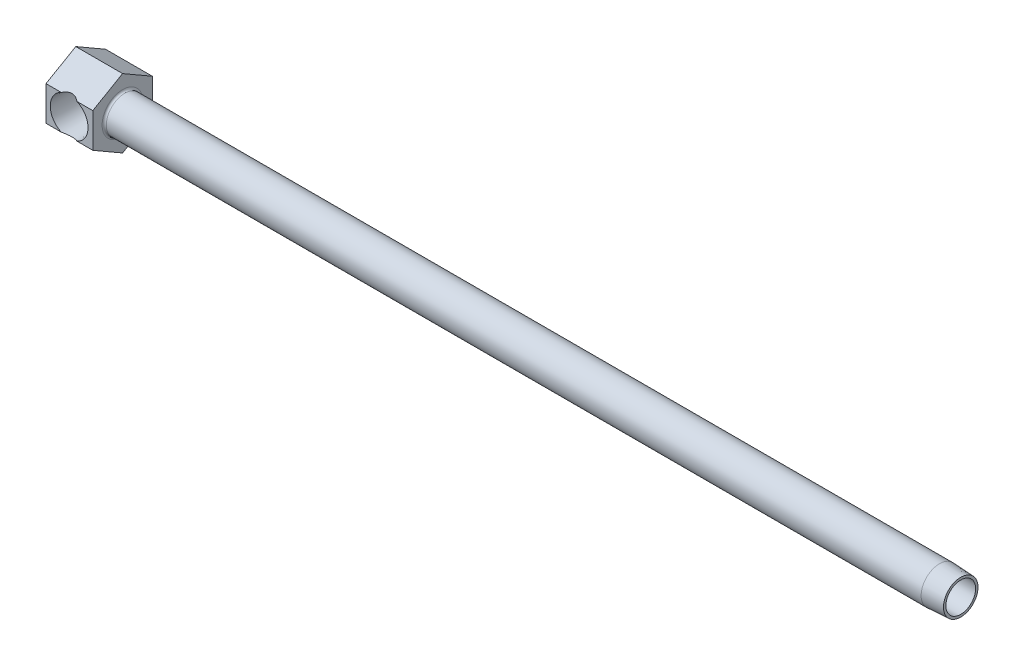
ISO-10303-21;
HEADER;
FILE_DESCRIPTION(('STEP AP214'),'2;1');
FILE_NAME('part.step','',(''),(''),'','','');
FILE_SCHEMA(('AUTOMOTIVE_DESIGN { 1 0 10303 214 1 1 1 1 }'));
ENDSEC;
DATA;
#1=APPLICATION_CONTEXT('core data for automotive mechanical design processes');
#2=APPLICATION_PROTOCOL_DEFINITION('international standard','automotive_design',2000,#1);
#3=PRODUCT_CONTEXT('',#1,'mechanical');
#4=PRODUCT('Part','Part','',(#3));
#5=PRODUCT_RELATED_PRODUCT_CATEGORY('part','',(#4));
#6=PRODUCT_DEFINITION_FORMATION('','',#4);
#7=PRODUCT_DEFINITION_CONTEXT('part definition',#1,'design');
#8=PRODUCT_DEFINITION('design','',#6,#7);
#9=PRODUCT_DEFINITION_SHAPE('','',#8);
#10=(LENGTH_UNIT() NAMED_UNIT(*) SI_UNIT(.MILLI.,.METRE.));
#11=(NAMED_UNIT(*) PLANE_ANGLE_UNIT() SI_UNIT($,.RADIAN.));
#12=(NAMED_UNIT(*) SI_UNIT($,.STERADIAN.) SOLID_ANGLE_UNIT());
#13=UNCERTAINTY_MEASURE_WITH_UNIT(LENGTH_MEASURE(1.E-05),#10,'distance_accuracy_value','');
#14=(GEOMETRIC_REPRESENTATION_CONTEXT(3) GLOBAL_UNCERTAINTY_ASSIGNED_CONTEXT((#13)) GLOBAL_UNIT_ASSIGNED_CONTEXT((#10,
#11,#12)) REPRESENTATION_CONTEXT('',''));
#15=CARTESIAN_POINT('',(0.,0.,0.));
#16=DIRECTION('',(0.,0.,1.));
#17=DIRECTION('',(1.,0.,0.));
#18=AXIS2_PLACEMENT_3D('',#15,#16,#17);
#19=CARTESIAN_POINT('',(63.5,0.,11.1125));
#20=DIRECTION('',(-1.,0.,0.));
#21=DIRECTION('',(0.,0.,1.));
#22=AXIS2_PLACEMENT_3D('',#19,#20,#21);
#23=CYLINDRICAL_SURFACE('',#22,6.858);
#24=CARTESIAN_POINT('',(18.2499,0.,11.1125));
#25=DIRECTION('',(-1.,0.,0.));
#26=DIRECTION('',(0.,-1.,0.));
#27=AXIS2_PLACEMENT_3D('',#24,#25,#26);
#28=CIRCLE('',#27,6.858);
#29=CARTESIAN_POINT('',(18.2499,-6.858,11.1125));
#30=VERTEX_POINT('',#29);
#31=EDGE_CURVE('E174',#30,#30,#28,.F.);
#32=ORIENTED_EDGE('',*,*,#31,.T.);
#33=EDGE_LOOP('',(#32));
#34=FACE_BOUND('',#33,.T.);
#35=CARTESIAN_POINT('',(322.2752,0.,11.1125));
#36=DIRECTION('',(1.,0.,0.));
#37=DIRECTION('',(0.,0.,-1.));
#38=AXIS2_PLACEMENT_3D('',#35,#36,#37);
#39=CIRCLE('',#38,6.858);
#40=CARTESIAN_POINT('',(322.2752,0.,4.2545));
#41=VERTEX_POINT('',#40);
#42=EDGE_CURVE('E218',#41,#41,#39,.T.);
#43=ORIENTED_EDGE('',*,*,#42,.F.);
#44=EDGE_LOOP('',(#43));
#45=FACE_BOUND('',#44,.T.);
#46=ADVANCED_FACE('F15',(#34,#45),#23,.T.);
#47=CARTESIAN_POINT('',(17.4625,6.4158048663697,22.225));
#48=DIRECTION('',(0.,0.,-1.));
#49=DIRECTION('',(0.,1.,0.));
#50=AXIS2_PLACEMENT_3D('',#47,#48,#49);
#51=PLANE('',#50);
#52=CARTESIAN_POINT('',(8.636,0.,22.225));
#53=DIRECTION('',(0.,0.,1.));
#54=DIRECTION('',(1.,0.,0.));
#55=AXIS2_PLACEMENT_3D('',#52,#53,#54);
#56=CIRCLE('',#55,7.05231);
#57=CARTESIAN_POINT('',(5.70811266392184,6.4158048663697,22.225));
#58=VERTEX_POINT('',#57);
#59=CARTESIAN_POINT('',(5.70811266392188,-6.41580486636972,22.225));
#60=VERTEX_POINT('',#59);
#61=EDGE_CURVE('E229',#58,#60,#56,.T.);
#62=ORIENTED_EDGE('',*,*,#61,.F.);
#63=DIRECTION('',(-1.,0.,0.));
#64=VECTOR('',#63,1.);
#65=CARTESIAN_POINT('',(17.4625,6.4158048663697,22.225));
#66=LINE('',#65,#64);
#67=CARTESIAN_POINT('',(0.,6.4158048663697,22.225));
#68=VERTEX_POINT('',#67);
#69=EDGE_CURVE('E158',#58,#68,#66,.T.);
#70=ORIENTED_EDGE('',*,*,#69,.T.);
#71=DIRECTION('',(0.,-1.,0.));
#72=VECTOR('',#71,1.);
#73=CARTESIAN_POINT('',(0.,6.4158048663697,22.225));
#74=LINE('',#73,#72);
#75=CARTESIAN_POINT('',(0.,-6.41580486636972,22.225));
#76=VERTEX_POINT('',#75);
#77=EDGE_CURVE('E128',#68,#76,#74,.T.);
#78=ORIENTED_EDGE('',*,*,#77,.T.);
#79=DIRECTION('',(-1.,0.,0.));
#80=VECTOR('',#79,1.);
#81=CARTESIAN_POINT('',(17.4625,-6.41580486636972,22.225));
#82=LINE('',#81,#80);
#83=EDGE_CURVE('E154',#60,#76,#82,.T.);
#84=ORIENTED_EDGE('',*,*,#83,.F.);
#85=EDGE_LOOP('',(#62,#70,#78,#84));
#86=FACE_BOUND('',#85,.T.);
#87=ADVANCED_FACE('F205',(#86),#51,.F.);
#88=CARTESIAN_POINT('',(11.5638873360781,-6.41580486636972,22.225));
#89=VERTEX_POINT('',#88);
#90=CARTESIAN_POINT('',(11.5638873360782,6.4158048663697,22.225));
#91=VERTEX_POINT('',#90);
#92=EDGE_CURVE('E228',#89,#91,#56,.T.);
#93=ORIENTED_EDGE('',*,*,#92,.F.);
#94=CARTESIAN_POINT('',(17.4625,-6.41580486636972,22.225));
#95=VERTEX_POINT('',#94);
#96=EDGE_CURVE('E155',#95,#89,#82,.T.);
#97=ORIENTED_EDGE('',*,*,#96,.F.);
#98=DIRECTION('',(0.,-1.,0.));
#99=VECTOR('',#98,1.);
#100=CARTESIAN_POINT('',(17.4625,6.4158048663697,22.225));
#101=LINE('',#100,#99);
#102=CARTESIAN_POINT('',(17.4625,6.4158048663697,22.225));
#103=VERTEX_POINT('',#102);
#104=EDGE_CURVE('E145',#103,#95,#101,.T.);
#105=ORIENTED_EDGE('',*,*,#104,.F.);
#106=EDGE_CURVE('E159',#103,#91,#66,.T.);
#107=ORIENTED_EDGE('',*,*,#106,.T.);
#108=EDGE_LOOP('',(#93,#97,#105,#107));
#109=FACE_BOUND('',#108,.T.);
#110=ADVANCED_FACE('F211',(#109),#51,.F.);
#111=CARTESIAN_POINT('',(17.4625,12.8316097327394,11.1125));
#112=DIRECTION('',(0.,-0.866025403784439,-0.5));
#113=DIRECTION('',(0.,0.5,-0.866025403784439));
#114=AXIS2_PLACEMENT_3D('',#111,#112,#113);
#115=PLANE('',#114);
#116=ORIENTED_EDGE('',*,*,#69,.F.);
#117=CARTESIAN_POINT('',(8.636,-0.384020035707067,34.002642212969));
#118=DIRECTION('',(0.,-0.866025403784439,-0.5));
#119=DIRECTION('',(0.,-0.5,0.866025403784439));
#120=AXIS2_PLACEMENT_3D('',#117,#118,#119);
#121=ELLIPSE('',#120,14.8098967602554,7.39498405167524);
#122=EDGE_CURVE('E109',#58,#91,#121,.T.);
#123=ORIENTED_EDGE('',*,*,#122,.T.);
#124=ORIENTED_EDGE('',*,*,#106,.F.);
#125=DIRECTION('',(0.,-0.5,0.866025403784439));
#126=VECTOR('',#125,1.);
#127=CARTESIAN_POINT('',(17.4625,12.8316097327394,11.1125));
#128=LINE('',#127,#126);
#129=CARTESIAN_POINT('',(17.4625,12.8316097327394,11.1125));
#130=VERTEX_POINT('',#129);
#131=EDGE_CURVE('E143',#130,#103,#128,.T.);
#132=ORIENTED_EDGE('',*,*,#131,.F.);
#133=DIRECTION('',(-1.,0.,0.));
#134=VECTOR('',#133,1.);
#135=CARTESIAN_POINT('',(17.4625,12.8316097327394,11.1125));
#136=LINE('',#135,#134);
#137=CARTESIAN_POINT('',(0.,12.8316097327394,11.1125));
#138=VERTEX_POINT('',#137);
#139=EDGE_CURVE('E162',#130,#138,#136,.T.);
#140=ORIENTED_EDGE('',*,*,#139,.T.);
#141=DIRECTION('',(0.,-0.5,0.866025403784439));
#142=VECTOR('',#141,1.);
#143=CARTESIAN_POINT('',(0.,12.8316097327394,11.1125));
#144=LINE('',#143,#142);
#145=EDGE_CURVE('E124',#138,#68,#144,.T.);
#146=ORIENTED_EDGE('',*,*,#145,.T.);
#147=EDGE_LOOP('',(#116,#123,#124,#132,#140,#146));
#148=FACE_BOUND('',#147,.T.);
#149=ADVANCED_FACE('F257',(#148),#115,.F.);
#150=CARTESIAN_POINT('',(17.4625,-6.41580486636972,22.225));
#151=DIRECTION('',(0.,0.866025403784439,-0.5));
#152=DIRECTION('',(0.,0.5,0.866025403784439));
#153=AXIS2_PLACEMENT_3D('',#150,#151,#152);
#154=PLANE('',#153);
#155=ORIENTED_EDGE('',*,*,#96,.T.);
#156=CARTESIAN_POINT('',(8.636,0.384020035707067,34.0026422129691));
#157=DIRECTION('',(0.,0.866025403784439,-0.5));
#158=DIRECTION('',(0.,0.5,0.866025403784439));
#159=AXIS2_PLACEMENT_3D('',#156,#157,#158);
#160=ELLIPSE('',#159,14.8098967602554,7.39498405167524);
#161=EDGE_CURVE('E34',#89,#60,#160,.T.);
#162=ORIENTED_EDGE('',*,*,#161,.T.);
#163=ORIENTED_EDGE('',*,*,#83,.T.);
#164=DIRECTION('',(0.,-0.5,-0.866025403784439));
#165=VECTOR('',#164,1.);
#166=CARTESIAN_POINT('',(0.,-6.41580486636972,22.225));
#167=LINE('',#166,#165);
#168=CARTESIAN_POINT('',(0.,-12.8316097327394,11.1125));
#169=VERTEX_POINT('',#168);
#170=EDGE_CURVE('E132',#76,#169,#167,.T.);
#171=ORIENTED_EDGE('',*,*,#170,.T.);
#172=DIRECTION('',(-1.,0.,0.));
#173=VECTOR('',#172,1.);
#174=CARTESIAN_POINT('',(17.4625,-12.8316097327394,11.1125));
#175=LINE('',#174,#173);
#176=CARTESIAN_POINT('',(17.4625,-12.8316097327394,11.1125));
#177=VERTEX_POINT('',#176);
#178=EDGE_CURVE('E149',#177,#169,#175,.T.);
#179=ORIENTED_EDGE('',*,*,#178,.F.);
#180=DIRECTION('',(0.,-0.5,-0.866025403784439));
#181=VECTOR('',#180,1.);
#182=CARTESIAN_POINT('',(17.4625,-6.41580486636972,22.225));
#183=LINE('',#182,#181);
#184=EDGE_CURVE('E147',#95,#177,#183,.T.);
#185=ORIENTED_EDGE('',*,*,#184,.F.);
#186=EDGE_LOOP('',(#155,#162,#163,#171,#179,#185));
#187=FACE_BOUND('',#186,.T.);
#188=ADVANCED_FACE('F235',(#187),#154,.F.);
#189=CARTESIAN_POINT('',(17.4625,-12.8316097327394,11.1125));
#190=DIRECTION('',(0.,0.866025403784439,0.5));
#191=DIRECTION('',(0.,-0.5,0.866025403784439));
#192=AXIS2_PLACEMENT_3D('',#189,#190,#191);
#193=PLANE('',#192);
#194=DIRECTION('',(0.,0.5,-0.866025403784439));
#195=VECTOR('',#194,1.);
#196=CARTESIAN_POINT('',(0.,-12.8316097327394,11.1125));
#197=LINE('',#196,#195);
#198=CARTESIAN_POINT('',(0.,-6.41580486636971,0.));
#199=VERTEX_POINT('',#198);
#200=EDGE_CURVE('E117',#169,#199,#197,.T.);
#201=ORIENTED_EDGE('',*,*,#200,.T.);
#202=DIRECTION('',(-1.,0.,0.));
#203=VECTOR('',#202,1.);
#204=CARTESIAN_POINT('',(17.4625,-6.41580486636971,0.));
#205=LINE('',#204,#203);
#206=CARTESIAN_POINT('',(17.4625,-6.41580486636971,0.));
#207=VERTEX_POINT('',#206);
#208=EDGE_CURVE('E168',#207,#199,#205,.T.);
#209=ORIENTED_EDGE('',*,*,#208,.F.);
#210=DIRECTION('',(0.,0.5,-0.866025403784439));
#211=VECTOR('',#210,1.);
#212=CARTESIAN_POINT('',(17.4625,-12.8316097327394,11.1125));
#213=LINE('',#212,#211);
#214=EDGE_CURVE('E135',#177,#207,#213,.T.);
#215=ORIENTED_EDGE('',*,*,#214,.F.);
#216=ORIENTED_EDGE('',*,*,#178,.T.);
#217=EDGE_LOOP('',(#201,#209,#215,#216));
#218=FACE_BOUND('',#217,.T.);
#219=ADVANCED_FACE('F247',(#218),#193,.F.);
#220=CARTESIAN_POINT('',(17.4625,-6.41580486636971,0.));
#221=DIRECTION('',(0.,0.,1.));
#222=DIRECTION('',(1.,0.,0.));
#223=AXIS2_PLACEMENT_3D('',#220,#221,#222);
#224=PLANE('',#223);
#225=DIRECTION('',(0.,1.,0.));
#226=VECTOR('',#225,1.);
#227=CARTESIAN_POINT('',(0.,-6.41580486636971,0.));
#228=LINE('',#227,#226);
#229=CARTESIAN_POINT('',(0.,6.41580486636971,0.));
#230=VERTEX_POINT('',#229);
#231=EDGE_CURVE('E118',#199,#230,#228,.T.);
#232=ORIENTED_EDGE('',*,*,#231,.T.);
#233=DIRECTION('',(-1.,0.,0.));
#234=VECTOR('',#233,1.);
#235=CARTESIAN_POINT('',(17.4625,6.41580486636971,0.));
#236=LINE('',#235,#234);
#237=CARTESIAN_POINT('',(17.4625,6.41580486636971,0.));
#238=VERTEX_POINT('',#237);
#239=EDGE_CURVE('E165',#238,#230,#236,.T.);
#240=ORIENTED_EDGE('',*,*,#239,.F.);
#241=DIRECTION('',(0.,1.,0.));
#242=VECTOR('',#241,1.);
#243=CARTESIAN_POINT('',(17.4625,-6.41580486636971,0.));
#244=LINE('',#243,#242);
#245=EDGE_CURVE('E139',#207,#238,#244,.T.);
#246=ORIENTED_EDGE('',*,*,#245,.F.);
#247=ORIENTED_EDGE('',*,*,#208,.T.);
#248=EDGE_LOOP('',(#232,#240,#246,#247));
#249=FACE_BOUND('',#248,.T.);
#250=ADVANCED_FACE('F264',(#249),#224,.F.);
#251=CARTESIAN_POINT('',(17.4625,6.4158048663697,0.));
#252=DIRECTION('',(0.,-0.866025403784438,0.5));
#253=DIRECTION('',(0.,-0.5,-0.866025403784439));
#254=AXIS2_PLACEMENT_3D('',#251,#252,#253);
#255=PLANE('',#254);
#256=DIRECTION('',(0.,0.5,0.866025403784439));
#257=VECTOR('',#256,1.);
#258=CARTESIAN_POINT('',(0.,6.4158048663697,0.));
#259=LINE('',#258,#257);
#260=EDGE_CURVE('E121',#230,#138,#259,.T.);
#261=ORIENTED_EDGE('',*,*,#260,.T.);
#262=ORIENTED_EDGE('',*,*,#139,.F.);
#263=DIRECTION('',(0.,0.5,0.866025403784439));
#264=VECTOR('',#263,1.);
#265=CARTESIAN_POINT('',(17.4625,6.4158048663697,0.));
#266=LINE('',#265,#264);
#267=EDGE_CURVE('E141',#238,#130,#266,.T.);
#268=ORIENTED_EDGE('',*,*,#267,.F.);
#269=ORIENTED_EDGE('',*,*,#239,.T.);
#270=EDGE_LOOP('',(#261,#262,#268,#269));
#271=FACE_BOUND('',#270,.T.);
#272=ADVANCED_FACE('F261',(#271),#255,.F.);
#273=CARTESIAN_POINT('',(17.4625,-19.2474145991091,22.225));
#274=DIRECTION('',(-1.,0.,0.));
#275=DIRECTION('',(0.,-1.,0.));
#276=AXIS2_PLACEMENT_3D('',#273,#274,#275);
#277=PLANE('',#276);
#278=CARTESIAN_POINT('',(17.4625,0.,11.1125));
#279=DIRECTION('',(-1.,0.,0.));
#280=DIRECTION('',(0.,-1.,0.));
#281=AXIS2_PLACEMENT_3D('',#278,#279,#280);
#282=CIRCLE('',#281,7.6454);
#283=CARTESIAN_POINT('',(17.4625,-7.6454,11.1125));
#284=VERTEX_POINT('',#283);
#285=EDGE_CURVE('E171',#284,#284,#282,.T.);
#286=ORIENTED_EDGE('',*,*,#285,.T.);
#287=EDGE_LOOP('',(#286));
#288=FACE_BOUND('',#287,.T.);
#289=ORIENTED_EDGE('',*,*,#214,.T.);
#290=ORIENTED_EDGE('',*,*,#245,.T.);
#291=ORIENTED_EDGE('',*,*,#267,.T.);
#292=ORIENTED_EDGE('',*,*,#131,.T.);
#293=ORIENTED_EDGE('',*,*,#104,.T.);
#294=ORIENTED_EDGE('',*,*,#184,.T.);
#295=EDGE_LOOP('',(#289,#290,#291,#292,#293,#294));
#296=FACE_BOUND('',#295,.T.);
#297=ADVANCED_FACE('F250',(#288,#296),#277,.F.);
#298=CARTESIAN_POINT('',(0.,-19.2474145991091,22.225));
#299=DIRECTION('',(-1.,0.,0.));
#300=DIRECTION('',(0.,-1.,0.));
#301=AXIS2_PLACEMENT_3D('',#298,#299,#300);
#302=PLANE('',#301);
#303=ORIENTED_EDGE('',*,*,#200,.F.);
#304=ORIENTED_EDGE('',*,*,#170,.F.);
#305=ORIENTED_EDGE('',*,*,#77,.F.);
#306=ORIENTED_EDGE('',*,*,#145,.F.);
#307=ORIENTED_EDGE('',*,*,#260,.F.);
#308=ORIENTED_EDGE('',*,*,#231,.F.);
#309=EDGE_LOOP('',(#303,#304,#305,#306,#307,#308));
#310=FACE_BOUND('',#309,.T.);
#311=ADVANCED_FACE('F243',(#310),#302,.T.);
#312=CARTESIAN_POINT('',(18.2499,0.,11.1125));
#313=DIRECTION('',(-1.,0.,0.));
#314=DIRECTION('',(0.,-1.,0.));
#315=AXIS2_PLACEMENT_3D('',#312,#313,#314);
#316=TOROIDAL_SURFACE('',#315,7.6454,0.7874);
#317=ORIENTED_EDGE('',*,*,#31,.F.);
#318=EDGE_LOOP('',(#317));
#319=FACE_BOUND('',#318,.T.);
#320=ORIENTED_EDGE('',*,*,#285,.F.);
#321=EDGE_LOOP('',(#320));
#322=FACE_BOUND('',#321,.T.);
#323=ADVANCED_FACE('F282',(#319,#322),#316,.F.);
#324=CARTESIAN_POINT('',(63.5,0.,11.1125));
#325=DIRECTION('',(1.,0.,0.));
#326=DIRECTION('',(0.,0.,-1.));
#327=AXIS2_PLACEMENT_3D('',#324,#325,#326);
#328=CYLINDRICAL_SURFACE('',#327,5.5499);
#329=DIRECTION('',(1.,0.,0.));
#330=VECTOR('',#329,1.);
#331=CARTESIAN_POINT('',(63.5,1.29165930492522,5.715));
#332=LINE('',#331,#330);
#333=CARTESIAN_POINT('',(15.0655177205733,1.29165930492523,5.715));
#334=VERTEX_POINT('',#333);
#335=CARTESIAN_POINT('',(14.0465577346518,1.29165930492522,5.715));
#336=VERTEX_POINT('',#335);
#337=EDGE_CURVE('E27',#334,#336,#332,.F.);
#338=ORIENTED_EDGE('',*,*,#337,.T.);
#339=CARTESIAN_POINT('',(14.0465577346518,1.29165930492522,5.715));
#340=CARTESIAN_POINT('',(14.0725617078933,1.1828202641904,5.68893317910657));
#341=CARTESIAN_POINT('',(14.0954190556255,1.0724477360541,5.66602138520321));
#342=CARTESIAN_POINT('',(14.1345363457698,0.849345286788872,5.62681178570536));
#343=CARTESIAN_POINT('',(14.1507939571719,0.736614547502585,5.61051631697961));
#344=CARTESIAN_POINT('',(14.1760383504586,0.512691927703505,5.58521342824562));
#345=CARTESIAN_POINT('',(14.1852120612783,0.401542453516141,5.57601863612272));
#346=CARTESIAN_POINT('',(14.1968530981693,0.17856718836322,5.56435088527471));
#347=CARTESIAN_POINT('',(14.1993222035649,0.0667415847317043,5.56187614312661));
#348=CARTESIAN_POINT('',(14.1975723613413,-0.14949882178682,5.56362999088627));
#349=CARTESIAN_POINT('',(14.193779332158,-0.253921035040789,5.56743168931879));
#350=CARTESIAN_POINT('',(14.1803598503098,-0.462026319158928,5.58088200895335));
#351=CARTESIAN_POINT('',(14.1707325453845,-0.565709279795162,5.59053148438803));
#352=CARTESIAN_POINT('',(14.1454600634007,-0.774399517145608,5.61586264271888));
#353=CARTESIAN_POINT('',(14.12966315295,-0.87936981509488,5.63169642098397));
#354=CARTESIAN_POINT('',(14.092340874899,-1.08722287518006,5.6691068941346));
#355=CARTESIAN_POINT('',(14.0708169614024,-1.1901061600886,5.69068213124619));
#356=CARTESIAN_POINT('',(14.0465577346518,-1.29165930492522,5.715));
#357=B_SPLINE_CURVE_WITH_KNOTS('',3,(#339,#340,#341,#342,#343,#344,#345,#346,#347,#348,#349,
#350,#351,#352,#353,#354,#355,#356),.UNSPECIFIED.,.F.,.F.,(4,2,2,2,2,2,2,2,4),(0.,
0.344637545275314,0.689396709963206,1.02471413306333,1.35994255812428,1.67329546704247,
1.98669416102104,2.30834220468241,2.62990865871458),.UNSPECIFIED.);
#358=CARTESIAN_POINT('',(14.0465577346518,-1.29165930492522,5.715));
#359=VERTEX_POINT('',#358);
#360=EDGE_CURVE('E10',#336,#359,#357,.T.);
#361=ORIENTED_EDGE('',*,*,#360,.T.);
#362=DIRECTION('',(1.,0.,0.));
#363=VECTOR('',#362,1.);
#364=CARTESIAN_POINT('',(63.5,-1.29165930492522,5.715));
#365=LINE('',#364,#363);
#366=CARTESIAN_POINT('',(15.0655177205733,-1.29165930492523,5.715));
#367=VERTEX_POINT('',#366);
#368=EDGE_CURVE('E184',#359,#367,#365,.T.);
#369=ORIENTED_EDGE('',*,*,#368,.T.);
#370=CARTESIAN_POINT('',(15.0656795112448,-1.29082327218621,5.71480000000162));
#371=CARTESIAN_POINT('',(15.0372536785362,-1.43791824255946,5.7499521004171));
#372=CARTESIAN_POINT('',(15.0041876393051,-1.58262926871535,5.79093746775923));
#373=CARTESIAN_POINT('',(14.9298152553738,-1.86616189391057,5.88364074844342));
#374=CARTESIAN_POINT('',(14.8885204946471,-2.00499144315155,5.93534357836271));
#375=CARTESIAN_POINT('',(14.7990709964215,-2.27477346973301,6.0481148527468));
#376=CARTESIAN_POINT('',(14.7509848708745,-2.40578805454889,6.10909004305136));
#377=CARTESIAN_POINT('',(14.6486806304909,-2.66083130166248,6.2399326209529));
#378=CARTESIAN_POINT('',(14.5944604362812,-2.78485757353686,6.30980302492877));
#379=CARTESIAN_POINT('',(14.4812536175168,-3.02482355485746,6.4572285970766));
#380=CARTESIAN_POINT('',(14.4222960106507,-3.1408054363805,6.53473755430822));
#381=CARTESIAN_POINT('',(14.3003856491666,-3.365215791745,6.6970845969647));
#382=CARTESIAN_POINT('',(14.2374332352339,-3.47364490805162,6.78192205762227));
#383=CARTESIAN_POINT('',(14.0435453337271,-3.78827180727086,7.04729631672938));
#384=CARTESIAN_POINT('',(13.9079456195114,-3.9830565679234,7.23822682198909));
#385=CARTESIAN_POINT('',(13.689310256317,-4.26816238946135,7.56146618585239));
#386=CARTESIAN_POINT('',(13.6074310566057,-4.3686517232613,7.68585924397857));
#387=CARTESIAN_POINT('',(13.4442899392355,-4.55879004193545,7.94320688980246));
#388=CARTESIAN_POINT('',(13.3630282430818,-4.6484352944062,8.07616440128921));
#389=CARTESIAN_POINT('',(13.2036424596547,-4.81645966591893,8.35044586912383));
#390=CARTESIAN_POINT('',(13.1255135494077,-4.89485662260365,8.49175606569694));
#391=CARTESIAN_POINT('',(12.9752684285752,-5.04004510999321,8.78316437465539));
#392=CARTESIAN_POINT('',(12.9031480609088,-5.10684469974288,8.93325628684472));
#393=CARTESIAN_POINT('',(12.757824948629,-5.23785122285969,9.26762207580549));
#394=CARTESIAN_POINT('',(12.686320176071,-5.29990617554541,9.45350692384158));
#395=CARTESIAN_POINT('',(12.5645322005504,-5.40502712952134,9.83721903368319));
#396=CARTESIAN_POINT('',(12.5142004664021,-5.44813656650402,10.035017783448));
#397=CARTESIAN_POINT('',(12.4606756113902,-5.49679755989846,10.3395644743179));
#398=CARTESIAN_POINT('',(12.4464754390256,-5.51038902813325,10.443158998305));
#399=CARTESIAN_POINT('',(12.4264834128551,-5.5317354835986,10.6517762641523));
#400=CARTESIAN_POINT('',(12.4206908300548,-5.53949097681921,10.7567988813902));
#401=CARTESIAN_POINT('',(12.4179376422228,-5.54899639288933,10.9671942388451));
#402=CARTESIAN_POINT('',(12.4209736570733,-5.55074861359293,11.0725668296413));
#403=CARTESIAN_POINT('',(12.4357182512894,-5.54828805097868,11.2826067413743));
#404=CARTESIAN_POINT('',(12.4474268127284,-5.54407527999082,11.3872740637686));
#405=CARTESIAN_POINT('',(12.4900727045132,-5.52483789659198,11.6684350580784));
#406=CARTESIAN_POINT('',(12.5287513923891,-5.5042766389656,11.8434168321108));
#407=CARTESIAN_POINT('',(12.6245766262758,-5.44793106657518,12.1856637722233));
#408=CARTESIAN_POINT('',(12.6817493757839,-5.41212512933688,12.3529176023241));
#409=CARTESIAN_POINT('',(12.8020710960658,-5.33165221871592,12.6608364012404));
#410=CARTESIAN_POINT('',(12.8638814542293,-5.28838367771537,12.8024081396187));
#411=CARTESIAN_POINT('',(12.9946271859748,-5.19196308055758,13.0788046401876));
#412=CARTESIAN_POINT('',(13.0635675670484,-5.13880405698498,13.2136245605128));
#413=CARTESIAN_POINT('',(13.2061680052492,-5.0230773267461,13.476991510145));
#414=CARTESIAN_POINT('',(13.2798387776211,-4.96048779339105,13.6055230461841));
#415=CARTESIAN_POINT('',(13.4297455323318,-4.82635797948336,13.8561944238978));
#416=CARTESIAN_POINT('',(13.505980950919,-4.75481965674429,13.9783356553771));
#417=CARTESIAN_POINT('',(13.664111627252,-4.59832635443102,14.2236446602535));
#418=CARTESIAN_POINT('',(13.7460684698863,-4.51281916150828,14.3464205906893));
#419=CARTESIAN_POINT('',(13.9094765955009,-4.33199713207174,14.5849036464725));
#420=CARTESIAN_POINT('',(13.9909278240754,-4.23668125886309,14.7006100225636));
#421=CARTESIAN_POINT('',(14.1517819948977,-4.03638256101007,14.9245234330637));
#422=CARTESIAN_POINT('',(14.231187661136,-3.93141354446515,15.0327408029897));
#423=CARTESIAN_POINT('',(14.3867175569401,-3.71172769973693,15.2413555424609));
#424=CARTESIAN_POINT('',(14.4628409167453,-3.59700831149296,15.3417508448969));
#425=CARTESIAN_POINT('',(14.668135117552,-3.26437402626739,15.6091426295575));
#426=CARTESIAN_POINT('',(14.7924014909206,-3.03572507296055,15.7670513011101));
#427=CARTESIAN_POINT('',(14.961823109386,-2.67104021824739,15.9794040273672));
#428=CARTESIAN_POINT('',(15.0154673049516,-2.54586009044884,16.0461031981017));
#429=CARTESIAN_POINT('',(15.1161712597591,-2.28856209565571,16.1705894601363));
#430=CARTESIAN_POINT('',(15.1632322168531,-2.15644549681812,16.2283781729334));
#431=CARTESIAN_POINT('',(15.2428146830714,-1.9076542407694,16.3256678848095));
#432=CARTESIAN_POINT('',(15.2764575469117,-1.79190088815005,16.3666154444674));
#433=CARTESIAN_POINT('',(15.3378292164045,-1.55651069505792,16.4410921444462));
#434=CARTESIAN_POINT('',(15.3655591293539,-1.43687458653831,16.4746226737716));
#435=CARTESIAN_POINT('',(15.4145953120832,-1.19439983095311,16.5337884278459));
#436=CARTESIAN_POINT('',(15.4359031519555,-1.0715619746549,16.5594255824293));
#437=CARTESIAN_POINT('',(15.4716760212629,-0.823504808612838,16.6024058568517));
#438=CARTESIAN_POINT('',(15.4861437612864,-0.698286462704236,16.6197522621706));
#439=CARTESIAN_POINT('',(15.5079865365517,-0.445852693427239,16.645922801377));
#440=CARTESIAN_POINT('',(15.5153340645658,-0.318631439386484,16.6547138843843));
#441=CARTESIAN_POINT('',(15.522677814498,-0.063671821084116,16.6635004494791));
#442=CARTESIAN_POINT('',(15.5226740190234,0.0640665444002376,16.6634959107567));
#443=CARTESIAN_POINT('',(15.5153149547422,0.319031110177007,16.6546910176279));
#444=CARTESIAN_POINT('',(15.5079593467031,0.446257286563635,16.64589025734));
#445=CARTESIAN_POINT('',(15.4860583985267,0.699182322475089,16.6196499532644));
#446=CARTESIAN_POINT('',(15.4715132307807,0.824881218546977,16.6022106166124));
#447=CARTESIAN_POINT('',(15.4365532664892,1.06681669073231,16.5602063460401));
#448=CARTESIAN_POINT('',(15.4165150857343,1.18318753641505,16.5360979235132));
#449=CARTESIAN_POINT('',(15.370668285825,1.41308832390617,16.4807930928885));
#450=CARTESIAN_POINT('',(15.3448577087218,1.52661728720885,16.4495942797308));
#451=CARTESIAN_POINT('',(15.2593968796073,1.8619852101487,16.3459550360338));
#452=CARTESIAN_POINT('',(15.1916934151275,2.07876635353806,16.2634431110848));
#453=CARTESIAN_POINT('',(15.0313088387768,2.51543897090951,16.0659794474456));
#454=CARTESIAN_POINT('',(14.9368359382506,2.73357267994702,15.9486491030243));
#455=CARTESIAN_POINT('',(14.7321201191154,3.14711164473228,15.6903358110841));
#456=CARTESIAN_POINT('',(14.6218705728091,3.34250728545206,15.549342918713));
#457=CARTESIAN_POINT('',(14.3660176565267,3.74896640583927,15.2149275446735));
#458=CARTESIAN_POINT('',(14.217881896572,3.95452519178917,15.0167316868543));
#459=CARTESIAN_POINT('',(13.9905991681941,4.23685264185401,14.7000501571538));
#460=CARTESIAN_POINT('',(13.9138995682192,4.32671599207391,14.5911203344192));
#461=CARTESIAN_POINT('',(13.7600052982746,4.49774000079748,14.366972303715));
#462=CARTESIAN_POINT('',(13.682810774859,4.57890311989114,14.2517558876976));
#463=CARTESIAN_POINT('',(13.5283146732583,4.73340315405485,14.0136509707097));
#464=CARTESIAN_POINT('',(13.4510233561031,4.80663208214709,13.8906858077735));
#465=CARTESIAN_POINT('',(13.2989020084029,4.94395744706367,13.6382338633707));
#466=CARTESIAN_POINT('',(13.2240725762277,5.00805167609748,13.5087455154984));
#467=CARTESIAN_POINT('',(13.0790371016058,5.12664196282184,13.2432341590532));
#468=CARTESIAN_POINT('',(13.0088235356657,5.18115389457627,13.107222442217));
#469=CARTESIAN_POINT('',(12.8755190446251,5.28008101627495,12.8283198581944));
#470=CARTESIAN_POINT('',(12.8124234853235,5.3245027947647,12.6854335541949));
#471=CARTESIAN_POINT('',(12.6833891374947,5.4112685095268,12.3591277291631));
#472=CARTESIAN_POINT('',(12.6200540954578,5.45085356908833,12.1738679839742));
#473=CARTESIAN_POINT('',(12.5423523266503,5.49611259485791,11.8892630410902));
#474=CARTESIAN_POINT('',(12.5193453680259,5.50884182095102,11.7933456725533));
#475=CARTESIAN_POINT('',(12.4799604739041,5.52933440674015,11.5996550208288));
#476=CARTESIAN_POINT('',(12.4635791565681,5.53710030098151,11.5018827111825));
#477=CARTESIAN_POINT('',(12.4380468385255,5.54748556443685,11.3040796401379));
#478=CARTESIAN_POINT('',(12.4289726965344,5.55005064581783,11.2040359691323));
#479=CARTESIAN_POINT('',(12.418786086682,5.54973569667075,11.0035516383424));
#480=CARTESIAN_POINT('',(12.4176731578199,5.54685598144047,10.9031110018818));
#481=CARTESIAN_POINT('',(12.4234254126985,5.53566138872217,10.7027211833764));
#482=CARTESIAN_POINT('',(12.4302942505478,5.52734402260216,10.6027722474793));
#483=CARTESIAN_POINT('',(12.4515981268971,5.5054275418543,10.4042328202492));
#484=CARTESIAN_POINT('',(12.4660373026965,5.4918255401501,10.3056431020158));
#485=CARTESIAN_POINT('',(12.5044721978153,5.45712893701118,10.0955734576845));
#486=CARTESIAN_POINT('',(12.5295946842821,5.43520467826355,9.98443807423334));
#487=CARTESIAN_POINT('',(12.5874763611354,5.38514310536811,9.76556012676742));
#488=CARTESIAN_POINT('',(12.6202414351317,5.35700100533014,9.65782024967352));
#489=CARTESIAN_POINT('',(12.6919869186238,5.29489520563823,9.44585515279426));
#490=CARTESIAN_POINT('',(12.7309829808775,5.2609168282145,9.34163960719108));
#491=CARTESIAN_POINT('',(12.813732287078,5.18758941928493,9.13712531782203));
#492=CARTESIAN_POINT('',(12.8574843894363,5.14824167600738,9.03682564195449));
#493=CARTESIAN_POINT('',(12.9739768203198,5.04107082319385,8.78510193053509));
#494=CARTESIAN_POINT('',(13.0492646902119,4.96961386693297,8.63639571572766));
#495=CARTESIAN_POINT('',(13.2048344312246,4.81508369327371,8.34787401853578));
#496=CARTESIAN_POINT('',(13.2851189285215,4.73200433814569,8.20806329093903));
#497=CARTESIAN_POINT('',(13.4480056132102,4.55446924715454,7.93688996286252));
#498=CARTESIAN_POINT('',(13.5306114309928,4.45999483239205,7.80554179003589));
#499=CARTESIAN_POINT('',(13.6957298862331,4.25996324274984,7.55156980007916));
#500=CARTESIAN_POINT('',(13.7782425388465,4.15440825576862,7.42894426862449));
#501=CARTESIAN_POINT('',(13.9441031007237,3.92836612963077,7.18853642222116));
#502=CARTESIAN_POINT('',(14.0273794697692,3.80748613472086,7.0710730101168));
#503=CARTESIAN_POINT('',(14.1898135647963,3.55392137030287,6.84638586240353));
#504=CARTESIAN_POINT('',(14.2689704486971,3.42123420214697,6.73916421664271));
#505=CARTESIAN_POINT('',(14.420885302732,3.14485348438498,6.53641941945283));
#506=CARTESIAN_POINT('',(14.4936705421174,3.0012123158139,6.44084565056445));
#507=CARTESIAN_POINT('',(14.6312840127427,2.70291662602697,6.2621549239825));
#508=CARTESIAN_POINT('',(14.6961173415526,2.54826926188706,6.17902997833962));
#509=CARTESIAN_POINT('',(14.8204425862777,2.21665612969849,6.02094073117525));
#510=CARTESIAN_POINT('',(14.8791782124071,2.03888590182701,5.94704372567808));
#511=CARTESIAN_POINT('',(14.957111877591,1.76426185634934,5.84958505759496));
#512=CARTESIAN_POINT('',(14.9814347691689,1.67119024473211,5.81928093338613));
#513=CARTESIAN_POINT('',(15.0263924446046,1.48269404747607,5.76341790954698));
#514=CARTESIAN_POINT('',(15.047024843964,1.38726798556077,5.73786207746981));
#515=CARTESIAN_POINT('',(15.0656795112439,1.2908232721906,5.71480000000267));
#516=B_SPLINE_CURVE_WITH_KNOTS('',3,(#370,#371,#372,#373,#374,#375,#376,#377,#378,#379,#380,
#381,#382,#383,#384,#385,#386,#387,#388,#389,#390,#391,#392,#393,#394,#395,#396,#397,#398,#399,
#400,#401,#402,#403,#404,#405,#406,#407,#408,#409,#410,#411,#412,#413,#414,#415,#416,#417,#418,
#419,#420,#421,#422,#423,#424,#425,#426,#427,#428,#429,#430,#431,#432,#433,#434,#435,#436,#437,
#438,#439,#440,#441,#442,#443,#444,#445,#446,#447,#448,#449,#450,#451,#452,#453,#454,#455,#456,
#457,#458,#459,#460,#461,#462,#463,#464,#465,#466,#467,#468,#469,#470,#471,#472,#473,#474,#475,
#476,#477,#478,#479,#480,#481,#482,#483,#484,#485,#486,#487,#488,#489,#490,#491,#492,#493,#494,
#495,#496,#497,#498,#499,#500,#501,#502,#503,#504,#505,#506,#507,#508,#509,#510,#511,#512,#513,
#514,#515),.UNSPECIFIED.,.F.,.F.,(4,2,2,2,2,2,2,2,2,2,2,2,2,2,2,2,2,2,2,2,2,2,2,2,2,2,2,2,2,2,2,
2,2,2,2,2,2,2,2,2,2,2,2,2,2,2,2,2,2,2,2,2,2,2,2,2,2,2,2,2,2,2,2,2,2,2,2,2,2,2,2,2,4),(0.,
0.461329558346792,0.922014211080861,1.37833951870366,1.83481998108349,2.2886910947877,
2.74252355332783,3.65304009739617,4.19159436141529,4.73033346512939,5.26820855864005,
5.80570837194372,6.42981366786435,7.05248053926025,7.36837231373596,7.68423669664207,
7.99998016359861,8.31572297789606,8.85459341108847,9.39423071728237,9.87481564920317,
10.3557404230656,10.837795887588,11.3197460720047,11.8310943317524,12.3424966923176,
12.8531785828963,13.3639949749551,14.2729996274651,14.7275015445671,15.1819206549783,
15.5634665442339,15.9449409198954,16.3263219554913,16.707551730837,17.0902484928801,
17.472946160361,17.8556614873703,18.2383676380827,18.5995247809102,18.9608046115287,
19.682873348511,20.4753483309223,21.2681572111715,22.2295647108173,22.7113905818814,
23.1930798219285,23.6806666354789,24.1683710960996,24.6552598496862,25.1418297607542,
25.7388115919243,26.0368814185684,26.3347989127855,26.6358104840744,26.9368046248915,
27.237936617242,27.5392333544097,27.8867825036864,28.2346001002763,28.5833055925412,
28.9319275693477,29.4751694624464,30.0186993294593,30.5631325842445,31.1074585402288,
31.6708023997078,32.2342609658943,32.7951763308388,33.3557302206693,33.9579898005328,
34.2603814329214,34.5629677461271),.UNSPECIFIED.);
#517=EDGE_CURVE('E177',#367,#334,#516,.T.);
#518=ORIENTED_EDGE('',*,*,#517,.T.);
#519=EDGE_LOOP('',(#338,#361,#369,#518));
#520=FACE_BOUND('',#519,.T.);
#521=CARTESIAN_POINT('',(330.2,0.,11.1125));
#522=DIRECTION('',(1.,0.,0.));
#523=DIRECTION('',(0.,0.,-1.));
#524=AXIS2_PLACEMENT_3D('',#521,#522,#523);
#525=CIRCLE('',#524,5.5499);
#526=CARTESIAN_POINT('',(330.2,0.,5.5626));
#527=VERTEX_POINT('',#526);
#528=EDGE_CURVE('E223',#527,#527,#525,.T.);
#529=ORIENTED_EDGE('',*,*,#528,.T.);
#530=EDGE_LOOP('',(#529));
#531=FACE_BOUND('',#530,.T.);
#532=ADVANCED_FACE('F185',(#520,#531),#328,.F.);
#533=CARTESIAN_POINT('',(14.1986,0.,5.715));
#534=DIRECTION('',(0.,0.,-1.));
#535=DIRECTION('',(-1.,0.,0.));
#536=AXIS2_PLACEMENT_3D('',#533,#534,#535);
#537=PLANE('',#536);
#538=CARTESIAN_POINT('',(8.636,0.,5.715));
#539=DIRECTION('',(0.,0.,1.));
#540=DIRECTION('',(1.,0.,0.));
#541=AXIS2_PLACEMENT_3D('',#538,#539,#540);
#542=CIRCLE('',#541,6.55797849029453);
#543=EDGE_CURVE('E41',#334,#367,#542,.T.);
#544=ORIENTED_EDGE('',*,*,#543,.T.);
#545=ORIENTED_EDGE('',*,*,#368,.F.);
#546=CARTESIAN_POINT('',(8.636,0.,5.715));
#547=DIRECTION('',(0.,0.,1.));
#548=DIRECTION('',(1.,0.,0.));
#549=AXIS2_PLACEMENT_3D('',#546,#547,#548);
#550=CIRCLE('',#549,5.5626);
#551=EDGE_CURVE('E107',#336,#359,#550,.T.);
#552=ORIENTED_EDGE('',*,*,#551,.F.);
#553=ORIENTED_EDGE('',*,*,#337,.F.);
#554=EDGE_LOOP('',(#544,#545,#552,#553));
#555=FACE_BOUND('',#554,.T.);
#556=ADVANCED_FACE('F194',(#555),#537,.F.);
#557=CARTESIAN_POINT('',(8.636,0.,22.225));
#558=DIRECTION('',(0.,0.,1.));
#559=DIRECTION('',(1.,0.,0.));
#560=AXIS2_PLACEMENT_3D('',#557,#558,#559);
#561=CYLINDRICAL_SURFACE('',#560,5.5626);
#562=CARTESIAN_POINT('',(8.636,0.,4.445));
#563=DIRECTION('',(0.,0.,1.));
#564=DIRECTION('',(1.,0.,0.));
#565=AXIS2_PLACEMENT_3D('',#562,#563,#564);
#566=CIRCLE('',#565,5.5626);
#567=CARTESIAN_POINT('',(14.1986,0.,4.445));
#568=VERTEX_POINT('',#567);
#569=EDGE_CURVE('E105',#568,#568,#566,.T.);
#570=ORIENTED_EDGE('',*,*,#569,.F.);
#571=EDGE_LOOP('',(#570));
#572=FACE_BOUND('',#571,.T.);
#573=ORIENTED_EDGE('',*,*,#551,.T.);
#574=ORIENTED_EDGE('',*,*,#360,.F.);
#575=EDGE_LOOP('',(#573,#574));
#576=FACE_BOUND('',#575,.T.);
#577=ADVANCED_FACE('F192',(#572,#576),#561,.F.);
#578=CARTESIAN_POINT('',(8.636,0.,22.225));
#579=DIRECTION('',(0.,0.,1.));
#580=DIRECTION('',(1.,0.,0.));
#581=AXIS2_PLACEMENT_3D('',#578,#579,#580);
#582=CONICAL_SURFACE('',#581,7.05231,0.0299323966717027);
#583=ORIENTED_EDGE('',*,*,#543,.F.);
#584=ORIENTED_EDGE('',*,*,#517,.F.);
#585=EDGE_LOOP('',(#583,#584));
#586=FACE_BOUND('',#585,.T.);
#587=ORIENTED_EDGE('',*,*,#61,.T.);
#588=ORIENTED_EDGE('',*,*,#161,.F.);
#589=ORIENTED_EDGE('',*,*,#92,.T.);
#590=ORIENTED_EDGE('',*,*,#122,.F.);
#591=EDGE_LOOP('',(#587,#588,#589,#590));
#592=FACE_BOUND('',#591,.T.);
#593=ADVANCED_FACE('F101',(#586,#592),#582,.F.);
#594=CARTESIAN_POINT('',(8.636,0.,4.445));
#595=DIRECTION('',(0.,0.,1.));
#596=DIRECTION('',(1.,0.,0.));
#597=AXIS2_PLACEMENT_3D('',#594,#595,#596);
#598=CONICAL_SURFACE('',#597,5.5626,1.02974425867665);
#599=CARTESIAN_POINT('',(8.636,0.,1.10265272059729));
#600=VERTEX_POINT('',#599);
#601=VERTEX_LOOP('',#600);
#602=FACE_BOUND('',#601,.T.);
#603=ORIENTED_EDGE('',*,*,#569,.T.);
#604=EDGE_LOOP('',(#603));
#605=FACE_BOUND('',#604,.T.);
#606=ADVANCED_FACE('F97',(#602,#605),#598,.F.);
#607=CARTESIAN_POINT('',(330.2,0.,5.5626));
#608=DIRECTION('',(1.,0.,0.));
#609=DIRECTION('',(0.,0.,-1.));
#610=AXIS2_PLACEMENT_3D('',#607,#608,#609);
#611=PLANE('',#610);
#612=CARTESIAN_POINT('',(330.2,0.,11.1125));
#613=DIRECTION('',(1.,0.,0.));
#614=DIRECTION('',(0.,0.,-1.));
#615=AXIS2_PLACEMENT_3D('',#612,#613,#614);
#616=CIRCLE('',#615,6.44267883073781);
#617=CARTESIAN_POINT('',(330.2,0.,4.66982116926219));
#618=VERTEX_POINT('',#617);
#619=EDGE_CURVE('E220',#618,#618,#616,.T.);
#620=ORIENTED_EDGE('',*,*,#619,.T.);
#621=EDGE_LOOP('',(#620));
#622=FACE_BOUND('',#621,.T.);
#623=ORIENTED_EDGE('',*,*,#528,.F.);
#624=EDGE_LOOP('',(#623));
#625=FACE_BOUND('',#624,.T.);
#626=ADVANCED_FACE('F100',(#622,#625),#611,.T.);
#627=CARTESIAN_POINT('',(330.2,0.,11.1125));
#628=DIRECTION('',(-1.,0.,0.));
#629=DIRECTION('',(0.,0.,1.));
#630=AXIS2_PLACEMENT_3D('',#627,#628,#629);
#631=CONICAL_SURFACE('',#630,6.44267883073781,0.052359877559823);
#632=ORIENTED_EDGE('',*,*,#42,.T.);
#633=EDGE_LOOP('',(#632));
#634=FACE_BOUND('',#633,.T.);
#635=ORIENTED_EDGE('',*,*,#619,.F.);
#636=EDGE_LOOP('',(#635));
#637=FACE_BOUND('',#636,.T.);
#638=ADVANCED_FACE('F300',(#634,#637),#631,.T.);
#639=CLOSED_SHELL('',(#46,#87,#110,#149,#188,#219,#250,#272,#297,#311,#323,#532,#556,#577,#593,
#606,#626,#638));
#640=MANIFOLD_SOLID_BREP('B1',#639);
#641=ADVANCED_BREP_SHAPE_REPRESENTATION('',(#18,#640),#14);
#642=SHAPE_DEFINITION_REPRESENTATION(#9,#641);
ENDSEC;
END-ISO-10303-21;
